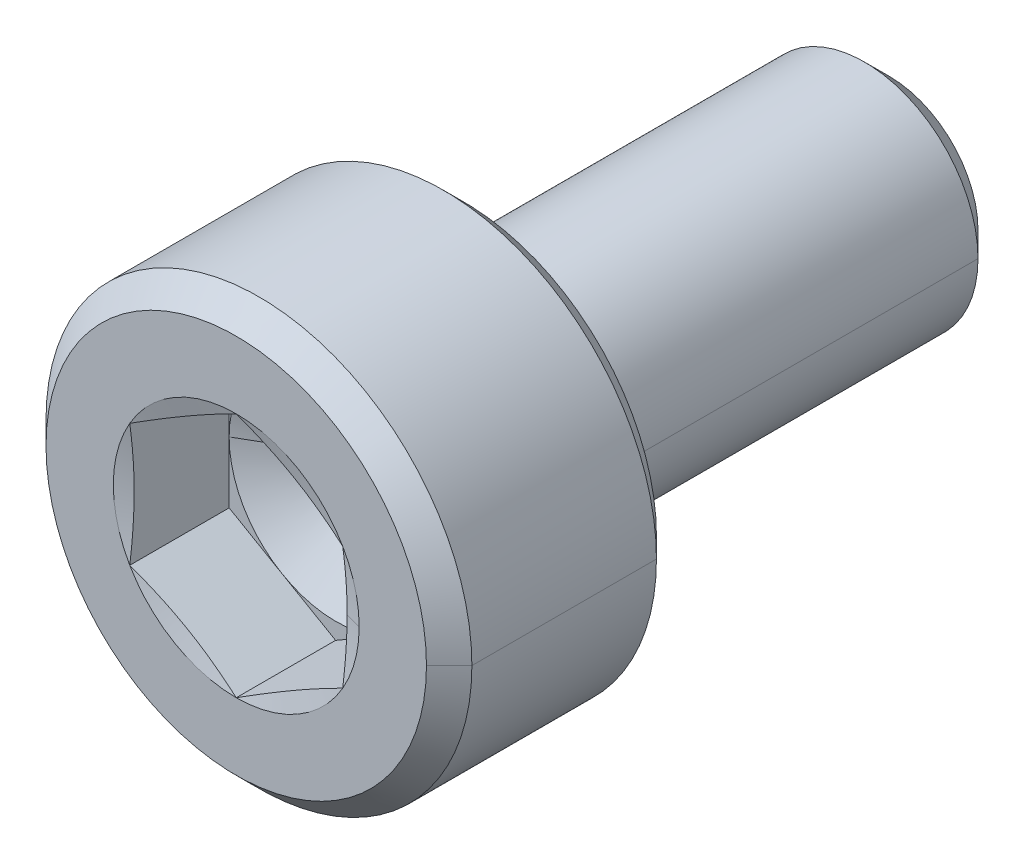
ISO-10303-21;
HEADER;
FILE_DESCRIPTION(('STEP AP214'),'2;1');
FILE_NAME('part.step','',(''),(''),'','','');
FILE_SCHEMA(('AUTOMOTIVE_DESIGN { 1 0 10303 214 1 1 1 1 }'));
ENDSEC;
DATA;
#1=APPLICATION_CONTEXT('core data for automotive mechanical design processes');
#2=APPLICATION_PROTOCOL_DEFINITION('international standard','automotive_design',2000,#1);
#3=PRODUCT_CONTEXT('',#1,'mechanical');
#4=PRODUCT('Part','Part','',(#3));
#5=PRODUCT_RELATED_PRODUCT_CATEGORY('part','',(#4));
#6=PRODUCT_DEFINITION_FORMATION('','',#4);
#7=PRODUCT_DEFINITION_CONTEXT('part definition',#1,'design');
#8=PRODUCT_DEFINITION('design','',#6,#7);
#9=PRODUCT_DEFINITION_SHAPE('','',#8);
#10=(LENGTH_UNIT() NAMED_UNIT(*) SI_UNIT(.MILLI.,.METRE.));
#11=(NAMED_UNIT(*) PLANE_ANGLE_UNIT() SI_UNIT($,.RADIAN.));
#12=(NAMED_UNIT(*) SI_UNIT($,.STERADIAN.) SOLID_ANGLE_UNIT());
#13=UNCERTAINTY_MEASURE_WITH_UNIT(LENGTH_MEASURE(1.E-05),#10,'distance_accuracy_value','');
#14=(GEOMETRIC_REPRESENTATION_CONTEXT(3) GLOBAL_UNCERTAINTY_ASSIGNED_CONTEXT((#13)) GLOBAL_UNIT_ASSIGNED_CONTEXT((#10,
#11,#12)) REPRESENTATION_CONTEXT('',''));
#15=CARTESIAN_POINT('',(0.,0.,0.));
#16=DIRECTION('',(0.,0.,1.));
#17=DIRECTION('',(1.,0.,0.));
#18=AXIS2_PLACEMENT_3D('',#15,#16,#17);
#19=CARTESIAN_POINT('',(0.75,0.433012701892,-0.7));
#20=DIRECTION('',(0.50000000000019,0.866025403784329,0.));
#21=DIRECTION('',(0.,0.,-1.));
#22=AXIS2_PLACEMENT_3D('',#19,#20,#21);
#23=PLANE('',#22);
#24=CARTESIAN_POINT('',(0.,0.866025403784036,-1.34102256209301E-13));
#25=CARTESIAN_POINT('',(0.0159598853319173,0.856809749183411,-0.00246925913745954));
#26=CARTESIAN_POINT('',(0.0319326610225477,0.847584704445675,-0.00482297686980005));
#27=CARTESIAN_POINT('',(0.0635921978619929,0.829301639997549,-0.00922985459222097));
#28=CARTESIAN_POINT('',(0.0792784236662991,0.820243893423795,-0.0112880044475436));
#29=CARTESIAN_POINT('',(0.110446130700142,0.802253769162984,-0.0151045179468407));
#30=CARTESIAN_POINT('',(0.125927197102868,0.793321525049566,-0.0168668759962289));
#31=CARTESIAN_POINT('',(0.156773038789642,0.775529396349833,-0.0200920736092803));
#32=CARTESIAN_POINT('',(0.172137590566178,0.766669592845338,-0.0215574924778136));
#33=CARTESIAN_POINT('',(0.203286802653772,0.748677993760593,-0.0242324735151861));
#34=CARTESIAN_POINT('',(0.21907163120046,0.739545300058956,-0.0254340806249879));
#35=CARTESIAN_POINT('',(0.25043259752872,0.721403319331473,-0.0274894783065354));
#36=CARTESIAN_POINT('',(0.266008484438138,0.712394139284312,-0.0283480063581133));
#37=CARTESIAN_POINT('',(0.297108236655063,0.694432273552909,-0.0297189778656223));
#38=CARTESIAN_POINT('',(0.312631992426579,0.685479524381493,-0.0302330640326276));
#39=CARTESIAN_POINT('',(0.343773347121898,0.667529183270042,-0.0309188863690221));
#40=CARTESIAN_POINT('',(0.359390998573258,0.658531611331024,-0.0310887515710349));
#41=CARTESIAN_POINT('',(0.39059960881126,0.640511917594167,-0.0310890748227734));
#42=CARTESIAN_POINT('',(0.406190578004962,0.631489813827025,-0.0309197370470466));
#43=CARTESIAN_POINT('',(0.437294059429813,0.613503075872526,-0.0302346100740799));
#44=CARTESIAN_POINT('',(0.452806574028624,0.604538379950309,-0.0297205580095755));
#45=CARTESIAN_POINT('',(0.483912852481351,0.586588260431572,-0.0283495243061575));
#46=CARTESIAN_POINT('',(0.499506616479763,0.577602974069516,-0.0274907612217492));
#47=CARTESIAN_POINT('',(0.530911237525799,0.559507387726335,-0.0254349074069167));
#48=CARTESIAN_POINT('',(0.546721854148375,0.550397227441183,-0.0242329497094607));
#49=CARTESIAN_POINT('',(0.577881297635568,0.532411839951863,-0.0215582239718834));
#50=CARTESIAN_POINT('',(0.593231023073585,0.523536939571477,-0.0200936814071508));
#51=CARTESIAN_POINT('',(0.624055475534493,0.50572232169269,-0.016869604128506));
#52=CARTESIAN_POINT('',(0.639530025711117,0.496782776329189,-0.0151074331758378));
#53=CARTESIAN_POINT('',(0.670694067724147,0.478786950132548,-0.0112908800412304));
#54=CARTESIAN_POINT('',(0.686383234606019,0.469730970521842,-0.00923244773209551));
#55=CARTESIAN_POINT('',(0.718053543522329,0.451451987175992,-0.00482454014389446));
#56=CARTESIAN_POINT('',(0.734034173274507,0.442229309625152,-0.00247002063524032));
#57=CARTESIAN_POINT('',(0.750000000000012,0.433012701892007,0.));
#58=B_SPLINE_CURVE_WITH_KNOTS('',3,(#24,#25,#26,#27,#28,#29,#30,#31,#32,#33,#34,#35,#36,#37,#38,
#39,#40,#41,#42,#43,#44,#45,#46,#47,#48,#49,#50,#51,#52,#53,#54,#55,#56,#57),.UNSPECIFIED.,.F.,
.F.,(4,2,2,2,2,2,2,2,2,2,2,2,2,2,2,2,4),(0.,0.0557827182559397,0.110471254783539,
0.164348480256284,0.217735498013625,0.2725605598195,0.326599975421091,0.380379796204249,
0.434451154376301,0.488489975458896,0.542258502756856,0.596308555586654,0.651166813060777,
0.704537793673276,0.758409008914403,0.813102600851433,0.868902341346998),.UNSPECIFIED.);
#59=CARTESIAN_POINT('',(0.,0.866025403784,0.));
#60=VERTEX_POINT('',#59);
#61=CARTESIAN_POINT('',(0.75,0.433012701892,0.));
#62=VERTEX_POINT('',#61);
#63=EDGE_CURVE('E399',#60,#62,#58,.T.);
#64=ORIENTED_EDGE('',*,*,#63,.F.);
#65=DIRECTION('',(0.,0.,1.));
#66=VECTOR('',#65,1.);
#67=CARTESIAN_POINT('',(0.,0.866025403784,-0.7));
#68=LINE('',#67,#66);
#69=CARTESIAN_POINT('',(0.,0.866025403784,-0.7));
#70=VERTEX_POINT('',#69);
#71=EDGE_CURVE('E51',#70,#60,#68,.T.);
#72=ORIENTED_EDGE('',*,*,#71,.F.);
#73=DIRECTION('',(-0.866025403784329,0.50000000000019,0.));
#74=VECTOR('',#73,1.);
#75=CARTESIAN_POINT('',(0.75,0.433012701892,-0.7));
#76=LINE('',#75,#74);
#77=CARTESIAN_POINT('',(0.375,0.649519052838,-0.7));
#78=VERTEX_POINT('',#77);
#79=EDGE_CURVE('E379',#78,#70,#76,.T.);
#80=ORIENTED_EDGE('',*,*,#79,.F.);
#81=DIRECTION('',(-0.866025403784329,0.50000000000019,0.));
#82=VECTOR('',#81,1.);
#83=CARTESIAN_POINT('',(0.75,0.433012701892,-0.7));
#84=LINE('',#83,#82);
#85=CARTESIAN_POINT('',(0.75,0.433012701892,-0.7));
#86=VERTEX_POINT('',#85);
#87=EDGE_CURVE('E391',#86,#78,#84,.T.);
#88=ORIENTED_EDGE('',*,*,#87,.F.);
#89=DIRECTION('',(0.,0.,1.));
#90=VECTOR('',#89,1.);
#91=CARTESIAN_POINT('',(0.75,0.433012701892,-0.7));
#92=LINE('',#91,#90);
#93=EDGE_CURVE('E11',#86,#62,#92,.T.);
#94=ORIENTED_EDGE('',*,*,#93,.T.);
#95=EDGE_LOOP('',(#64,#72,#80,#88,#94));
#96=FACE_BOUND('',#95,.T.);
#97=ADVANCED_FACE('F17',(#96),#23,.F.);
#98=CARTESIAN_POINT('',(0.75,-0.433012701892,-0.7));
#99=DIRECTION('',(1.,0.,0.));
#100=DIRECTION('',(0.,-1.,0.));
#101=AXIS2_PLACEMENT_3D('',#98,#99,#100);
#102=PLANE('',#101);
#103=CARTESIAN_POINT('',(0.750000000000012,0.433012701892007,0.));
#104=CARTESIAN_POINT('',(0.749998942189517,0.414599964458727,-0.00246701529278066));
#105=CARTESIAN_POINT('',(0.749996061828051,0.396171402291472,-0.00481873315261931));
#106=CARTESIAN_POINT('',(0.749991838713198,0.359645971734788,-0.00922207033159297));
#107=CARTESIAN_POINT('',(0.749990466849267,0.34154970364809,-0.0112786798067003));
#108=CARTESIAN_POINT('',(0.749993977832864,0.305597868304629,-0.0150925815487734));
#109=CARTESIAN_POINT('',(0.749998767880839,0.287742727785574,-0.016853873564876));
#110=CARTESIAN_POINT('',(0.750013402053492,0.252170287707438,-0.0200773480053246));
#111=CARTESIAN_POINT('',(0.750023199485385,0.234453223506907,-0.021542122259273));
#112=CARTESIAN_POINT('',(0.750017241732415,0.198478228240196,-0.0242195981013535));
#113=CARTESIAN_POINT('',(0.75000072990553,0.180219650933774,-0.0254236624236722));
#114=CARTESIAN_POINT('',(0.74996926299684,0.143948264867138,-0.027483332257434));
#115=CARTESIAN_POINT('',(0.749954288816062,0.125935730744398,-0.0283437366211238));
#116=CARTESIAN_POINT('',(0.7499487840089,0.0899867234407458,-0.0297169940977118));
#117=CARTESIAN_POINT('',(0.749958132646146,0.0720503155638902,-0.0302315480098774));
#118=CARTESIAN_POINT('',(0.74998101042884,0.0360759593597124,-0.0309196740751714));
#119=CARTESIAN_POINT('',(0.749994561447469,0.0180379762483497,-0.031091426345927));
#120=CARTESIAN_POINT('',(0.75,0.,-0.03108891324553));
#121=B_SPLINE_CURVE_WITH_KNOTS('',3,(#103,#104,#105,#106,#107,#108,#109,#110,#111,#112,#113,
#114,#115,#116,#117,#118,#119,#120),.UNSPECIFIED.,.F.,.F.,(4,2,2,2,2,2,2,2,4),(0.,
0.0557320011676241,0.110368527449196,0.164191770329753,0.217522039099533,0.272413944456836,
0.326510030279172,0.380338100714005,0.434451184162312),.UNSPECIFIED.);
#122=CARTESIAN_POINT('',(0.75,0.,-0.03108891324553));
#123=VERTEX_POINT('',#122);
#124=EDGE_CURVE('E272',#62,#123,#121,.T.);
#125=ORIENTED_EDGE('',*,*,#124,.F.);
#126=ORIENTED_EDGE('',*,*,#93,.F.);
#127=DIRECTION('',(0.,1.,0.));
#128=VECTOR('',#127,1.);
#129=CARTESIAN_POINT('',(0.75,-0.433012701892,-0.7));
#130=LINE('',#129,#128);
#131=CARTESIAN_POINT('',(0.75,0.,-0.7));
#132=VERTEX_POINT('',#131);
#133=EDGE_CURVE('E349',#132,#86,#130,.T.);
#134=ORIENTED_EDGE('',*,*,#133,.F.);
#135=DIRECTION('',(0.,1.,0.));
#136=VECTOR('',#135,1.);
#137=CARTESIAN_POINT('',(0.75,-0.433012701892,-0.7));
#138=LINE('',#137,#136);
#139=CARTESIAN_POINT('',(0.75,-0.433012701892,-0.7));
#140=VERTEX_POINT('',#139);
#141=EDGE_CURVE('E410',#140,#132,#138,.T.);
#142=ORIENTED_EDGE('',*,*,#141,.F.);
#143=DIRECTION('',(0.,0.,1.));
#144=VECTOR('',#143,1.);
#145=CARTESIAN_POINT('',(0.75,-0.433012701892,-0.7));
#146=LINE('',#145,#144);
#147=CARTESIAN_POINT('',(0.75,-0.433012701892,0.));
#148=VERTEX_POINT('',#147);
#149=EDGE_CURVE('E28',#140,#148,#146,.T.);
#150=ORIENTED_EDGE('',*,*,#149,.T.);
#151=CARTESIAN_POINT('',(0.75,0.,-0.03108891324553));
#152=CARTESIAN_POINT('',(0.749994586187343,-0.0180232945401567,-0.0310914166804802));
#153=CARTESIAN_POINT('',(0.749981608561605,-0.0360465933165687,-0.030919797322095));
#154=CARTESIAN_POINT('',(0.749960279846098,-0.0719949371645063,-0.0302323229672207));
#155=CARTESIAN_POINT('',(0.749951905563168,-0.0899200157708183,-0.0297182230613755));
#156=CARTESIAN_POINT('',(0.749959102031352,-0.125849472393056,-0.0283462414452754));
#157=CARTESIAN_POINT('',(0.749974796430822,-0.143853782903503,-0.0274866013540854));
#158=CARTESIAN_POINT('',(0.750006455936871,-0.180111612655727,-0.025428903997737));
#159=CARTESIAN_POINT('',(0.750022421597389,-0.198364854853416,-0.0242260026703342));
#160=CARTESIAN_POINT('',(0.750026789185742,-0.234343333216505,-0.0215500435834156));
#161=CARTESIAN_POINT('',(0.750015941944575,-0.252069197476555,-0.0200853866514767));
#162=CARTESIAN_POINT('',(0.749999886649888,-0.287659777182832,-0.0168616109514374));
#163=CARTESIAN_POINT('',(0.749994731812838,-0.305524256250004,-0.0150998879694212));
#164=CARTESIAN_POINT('',(0.749990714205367,-0.341495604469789,-0.0112846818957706));
#165=CARTESIAN_POINT('',(0.749991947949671,-0.359602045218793,-0.00922718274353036));
#166=CARTESIAN_POINT('',(0.749996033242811,-0.396148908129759,-0.00482160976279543));
#167=CARTESIAN_POINT('',(0.749998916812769,-0.414588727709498,-0.00246852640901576));
#168=CARTESIAN_POINT('',(0.750000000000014,-0.433012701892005,0.));
#169=B_SPLINE_CURVE_WITH_KNOTS('',3,(#151,#152,#153,#154,#155,#156,#157,#158,#159,#160,#161,
#162,#163,#164,#165,#166,#167,#168),.UNSPECIFIED.,.F.,.F.,(4,2,2,2,2,2,2,2,4),(0.,
0.0540690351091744,0.107863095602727,0.161934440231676,0.216810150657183,0.270166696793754,
0.324017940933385,0.378685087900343,0.434451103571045),.UNSPECIFIED.);
#170=EDGE_CURVE('E659',#123,#148,#169,.T.);
#171=ORIENTED_EDGE('',*,*,#170,.F.);
#172=EDGE_LOOP('',(#125,#126,#134,#142,#150,#171));
#173=FACE_BOUND('',#172,.T.);
#174=ADVANCED_FACE('F592',(#173),#102,.F.);
#175=CARTESIAN_POINT('',(0.,-0.866025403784,-0.7));
#176=DIRECTION('',(0.50000000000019,-0.866025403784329,0.));
#177=DIRECTION('',(0.,0.,-1.));
#178=AXIS2_PLACEMENT_3D('',#175,#176,#177);
#179=PLANE('',#178);
#180=CARTESIAN_POINT('',(0.750000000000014,-0.433012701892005,0.));
#181=CARTESIAN_POINT('',(0.734039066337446,-0.442226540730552,-0.00246925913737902));
#182=CARTESIAN_POINT('',(0.718063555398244,-0.451446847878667,-0.00482297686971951));
#183=CARTESIAN_POINT('',(0.686400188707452,-0.469723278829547,-0.00922985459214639));
#184=CARTESIAN_POINT('',(0.670712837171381,-0.478779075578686,-0.0112880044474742));
#185=CARTESIAN_POINT('',(0.639549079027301,-0.496776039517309,-0.0151045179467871));
#186=CARTESIAN_POINT('',(0.624072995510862,-0.505716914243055,-0.016866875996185));
#187=CARTESIAN_POINT('',(0.593241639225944,-0.523534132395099,-0.0200920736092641));
#188=CARTESIAN_POINT('',(0.577886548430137,-0.532410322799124,-0.0215574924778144));
#189=CARTESIAN_POINT('',(0.546730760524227,-0.550390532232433,-0.0242324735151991));
#190=CARTESIAN_POINT('',(0.530929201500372,-0.559494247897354,-0.0254340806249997));
#191=CARTESIAN_POINT('',(0.499537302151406,-0.577582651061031,-0.0274894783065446));
#192=CARTESIAN_POINT('',(0.48394717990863,-0.586567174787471,-0.0283480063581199));
#193=CARTESIAN_POINT('',(0.452841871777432,-0.604519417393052,-0.029718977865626));
#194=CARTESIAN_POINT('',(0.4373266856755,-0.613487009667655,-0.0302330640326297));
#195=CARTESIAN_POINT('',(0.406210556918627,-0.631481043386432,-0.0309188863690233));
#196=CARTESIAN_POINT('',(0.390609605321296,-0.640507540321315,-0.0310887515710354));
#197=CARTESIAN_POINT('',(0.359399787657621,-0.658525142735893,-0.0310890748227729));
#198=CARTESIAN_POINT('',(0.343790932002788,-0.667516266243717,-0.0309197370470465));
#199=CARTESIAN_POINT('',(0.312662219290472,-0.685459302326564,-0.0302346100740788));
#200=CARTESIAN_POINT('',(0.2971423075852,-0.694411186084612,-0.0297205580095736));
#201=CARTESIAN_POINT('',(0.266043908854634,-0.712374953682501,-0.0283495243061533));
#202=CARTESIAN_POINT('',(0.250465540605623,-0.721386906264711,-0.0274907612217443));
#203=CARTESIAN_POINT('',(0.219091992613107,-0.739536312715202,-0.0254349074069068));
#204=CARTESIAN_POINT('',(0.203297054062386,-0.748673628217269,-0.0242329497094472));
#205=CARTESIAN_POINT('',(0.172141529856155,-0.76666580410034,-0.0215582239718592));
#206=CARTESIAN_POINT('',(0.15678077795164,-0.775521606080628,-0.0200936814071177));
#207=CARTESIAN_POINT('',(0.125940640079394,-0.793309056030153,-0.0168696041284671));
#208=CARTESIAN_POINT('',(0.110461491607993,-0.802240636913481,-0.0151074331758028));
#209=CARTESIAN_POINT('',(0.0792946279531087,-0.820231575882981,-0.0112908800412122));
#210=CARTESIAN_POINT('',(0.0636073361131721,-0.829290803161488,-0.00923244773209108));
#211=CARTESIAN_POINT('',(0.0319421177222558,-0.847578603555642,-0.0048245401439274));
#212=CARTESIAN_POINT('',(0.015964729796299,-0.85680689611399,-0.00247002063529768));
#213=CARTESIAN_POINT('',(0.,-0.866025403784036,-1.34102256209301E-13));
#214=B_SPLINE_CURVE_WITH_KNOTS('',3,(#180,#181,#182,#183,#184,#185,#186,#187,#188,#189,#190,
#191,#192,#193,#194,#195,#196,#197,#198,#199,#200,#201,#202,#203,#204,#205,#206,#207,#208,#209,
#210,#211,#212,#213),.UNSPECIFIED.,.F.,.F.,(4,2,2,2,2,2,2,2,2,2,2,2,2,2,2,2,4),(0.,
0.0557827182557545,0.110471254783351,0.164348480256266,0.217735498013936,0.272560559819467,
0.326599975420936,0.380379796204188,0.434451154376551,0.488489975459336,0.54225850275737,
0.596308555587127,0.651166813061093,0.704537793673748,0.758409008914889,0.813102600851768,
0.868902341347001),.UNSPECIFIED.);
#215=CARTESIAN_POINT('',(0.,-0.866025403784,0.));
#216=VERTEX_POINT('',#215);
#217=EDGE_CURVE('E632',#148,#216,#214,.T.);
#218=ORIENTED_EDGE('',*,*,#217,.F.);
#219=ORIENTED_EDGE('',*,*,#149,.F.);
#220=DIRECTION('',(0.866025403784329,0.50000000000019,0.));
#221=VECTOR('',#220,1.);
#222=CARTESIAN_POINT('',(0.,-0.866025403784,-0.7));
#223=LINE('',#222,#221);
#224=CARTESIAN_POINT('',(0.375,-0.649519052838,-0.7));
#225=VERTEX_POINT('',#224);
#226=EDGE_CURVE('E406',#225,#140,#223,.T.);
#227=ORIENTED_EDGE('',*,*,#226,.F.);
#228=DIRECTION('',(0.866025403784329,0.50000000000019,0.));
#229=VECTOR('',#228,1.);
#230=CARTESIAN_POINT('',(0.,-0.866025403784,-0.7));
#231=LINE('',#230,#229);
#232=CARTESIAN_POINT('',(0.,-0.866025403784,-0.7));
#233=VERTEX_POINT('',#232);
#234=EDGE_CURVE('E308',#233,#225,#231,.T.);
#235=ORIENTED_EDGE('',*,*,#234,.F.);
#236=DIRECTION('',(0.,0.,1.));
#237=VECTOR('',#236,1.);
#238=CARTESIAN_POINT('',(0.,-0.866025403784,-0.7));
#239=LINE('',#238,#237);
#240=EDGE_CURVE('E545',#233,#216,#239,.T.);
#241=ORIENTED_EDGE('',*,*,#240,.T.);
#242=EDGE_LOOP('',(#218,#219,#227,#235,#241));
#243=FACE_BOUND('',#242,.T.);
#244=ADVANCED_FACE('F584',(#243),#179,.F.);
#245=CARTESIAN_POINT('',(-0.75,-0.433012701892,-0.7));
#246=DIRECTION('',(-0.50000000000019,-0.866025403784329,0.));
#247=DIRECTION('',(-0.866025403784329,0.50000000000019,0.));
#248=AXIS2_PLACEMENT_3D('',#245,#246,#247);
#249=PLANE('',#248);
#250=CARTESIAN_POINT('',(0.,-0.866025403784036,-1.34102256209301E-13));
#251=CARTESIAN_POINT('',(-0.0159598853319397,-0.856809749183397,-0.0024692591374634));
#252=CARTESIAN_POINT('',(-0.0319326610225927,-0.847584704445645,-0.00482297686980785));
#253=CARTESIAN_POINT('',(-0.0635921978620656,-0.829301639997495,-0.00922985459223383));
#254=CARTESIAN_POINT('',(-0.0792784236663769,-0.820243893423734,-0.0112880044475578));
#255=CARTESIAN_POINT('',(-0.110446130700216,-0.802253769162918,-0.0151045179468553));
#256=CARTESIAN_POINT('',(-0.125927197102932,-0.793321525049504,-0.0168668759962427));
#257=CARTESIAN_POINT('',(-0.15677303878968,-0.775529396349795,-0.020092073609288));
#258=CARTESIAN_POINT('',(-0.172137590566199,-0.766669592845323,-0.0215574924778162));
#259=CARTESIAN_POINT('',(-0.203286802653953,-0.748677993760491,-0.024232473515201));
#260=CARTESIAN_POINT('',(-0.219071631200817,-0.739545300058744,-0.0254340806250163));
#261=CARTESIAN_POINT('',(-0.250432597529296,-0.721403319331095,-0.0274894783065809));
#262=CARTESIAN_POINT('',(-0.266008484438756,-0.712394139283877,-0.0283480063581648));
#263=CARTESIAN_POINT('',(-0.297108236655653,-0.694432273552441,-0.0297189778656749));
#264=CARTESIAN_POINT('',(-0.312631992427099,-0.685479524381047,-0.030233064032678));
#265=CARTESIAN_POINT('',(-0.343773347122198,-0.667529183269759,-0.0309188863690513));
#266=CARTESIAN_POINT('',(-0.359390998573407,-0.658531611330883,-0.0310887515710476));
#267=CARTESIAN_POINT('',(-0.390599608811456,-0.640511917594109,-0.0310890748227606));
#268=CARTESIAN_POINT('',(-0.406190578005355,-0.631489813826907,-0.0309197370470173));
#269=CARTESIAN_POINT('',(-0.437294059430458,-0.6135030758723,-0.0302346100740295));
#270=CARTESIAN_POINT('',(-0.452806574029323,-0.604538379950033,-0.0297205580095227));
#271=CARTESIAN_POINT('',(-0.483912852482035,-0.586588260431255,-0.0283495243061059));
#272=CARTESIAN_POINT('',(-0.499506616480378,-0.577602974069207,-0.0274907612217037));
#273=CARTESIAN_POINT('',(-0.530911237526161,-0.559507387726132,-0.0254349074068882));
#274=CARTESIAN_POINT('',(-0.546721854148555,-0.550397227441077,-0.0242329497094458));
#275=CARTESIAN_POINT('',(-0.577881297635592,-0.532411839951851,-0.0215582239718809));
#276=CARTESIAN_POINT('',(-0.593231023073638,-0.523536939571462,-0.0200936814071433));
#277=CARTESIAN_POINT('',(-0.62405547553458,-0.505722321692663,-0.0168696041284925));
#278=CARTESIAN_POINT('',(-0.63953002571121,-0.496782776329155,-0.0151074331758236));
#279=CARTESIAN_POINT('',(-0.670694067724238,-0.478786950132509,-0.0112908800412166));
#280=CARTESIAN_POINT('',(-0.686383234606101,-0.469730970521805,-0.00923244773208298));
#281=CARTESIAN_POINT('',(-0.718053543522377,-0.451451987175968,-0.00482454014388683));
#282=CARTESIAN_POINT('',(-0.73403417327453,-0.44222930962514,-0.00247002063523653));
#283=CARTESIAN_POINT('',(-0.750000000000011,-0.433012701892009,0.));
#284=B_SPLINE_CURVE_WITH_KNOTS('',3,(#250,#251,#252,#253,#254,#255,#256,#257,#258,#259,#260,
#261,#262,#263,#264,#265,#266,#267,#268,#269,#270,#271,#272,#273,#274,#275,#276,#277,#278,#279,
#280,#281,#282,#283),.UNSPECIFIED.,.F.,.F.,(4,2,2,2,2,2,2,2,2,2,2,2,2,2,2,2,4),(0.,
0.0557827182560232,0.110471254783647,0.164348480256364,0.217735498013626,0.272560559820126,
0.326599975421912,0.380379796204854,0.434451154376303,0.488489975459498,0.542258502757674,
0.59630855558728,0.651166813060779,0.704537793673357,0.758409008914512,0.813102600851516,
0.868902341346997),.UNSPECIFIED.);
#285=CARTESIAN_POINT('',(-0.75,-0.433012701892,0.));
#286=VERTEX_POINT('',#285);
#287=EDGE_CURVE('E558',#216,#286,#284,.T.);
#288=ORIENTED_EDGE('',*,*,#287,.F.);
#289=ORIENTED_EDGE('',*,*,#240,.F.);
#290=DIRECTION('',(0.866025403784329,-0.50000000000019,0.));
#291=VECTOR('',#290,1.);
#292=CARTESIAN_POINT('',(-0.75,-0.433012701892,-0.7));
#293=LINE('',#292,#291);
#294=CARTESIAN_POINT('',(-0.375,-0.649519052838,-0.7));
#295=VERTEX_POINT('',#294);
#296=EDGE_CURVE('E411',#295,#233,#293,.T.);
#297=ORIENTED_EDGE('',*,*,#296,.F.);
#298=DIRECTION('',(0.866025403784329,-0.50000000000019,0.));
#299=VECTOR('',#298,1.);
#300=CARTESIAN_POINT('',(-0.75,-0.433012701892,-0.7));
#301=LINE('',#300,#299);
#302=CARTESIAN_POINT('',(-0.75,-0.433012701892,-0.7));
#303=VERTEX_POINT('',#302);
#304=EDGE_CURVE('E307',#303,#295,#301,.T.);
#305=ORIENTED_EDGE('',*,*,#304,.F.);
#306=DIRECTION('',(0.,0.,1.));
#307=VECTOR('',#306,1.);
#308=CARTESIAN_POINT('',(-0.75,-0.433012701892,-0.7));
#309=LINE('',#308,#307);
#310=EDGE_CURVE('E542',#303,#286,#309,.T.);
#311=ORIENTED_EDGE('',*,*,#310,.T.);
#312=EDGE_LOOP('',(#288,#289,#297,#305,#311));
#313=FACE_BOUND('',#312,.T.);
#314=ADVANCED_FACE('F472',(#313),#249,.F.);
#315=CARTESIAN_POINT('',(-0.75,0.433012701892,-0.7));
#316=DIRECTION('',(-1.,0.,0.));
#317=DIRECTION('',(0.,0.,1.));
#318=AXIS2_PLACEMENT_3D('',#315,#316,#317);
#319=PLANE('',#318);
#320=CARTESIAN_POINT('',(-0.750000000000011,-0.433012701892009,0.));
#321=CARTESIAN_POINT('',(-0.74999893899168,-0.414560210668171,-0.0024723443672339));
#322=CARTESIAN_POINT('',(-0.749996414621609,-0.396091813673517,-0.00482880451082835));
#323=CARTESIAN_POINT('',(-0.749993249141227,-0.359486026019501,-0.00924045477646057));
#324=CARTESIAN_POINT('',(-0.749992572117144,-0.341349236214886,-0.0113006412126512));
#325=CARTESIAN_POINT('',(-0.749997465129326,-0.305315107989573,-0.0151205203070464));
#326=CARTESIAN_POINT('',(-0.750002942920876,-0.287418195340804,-0.0168842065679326));
#327=CARTESIAN_POINT('',(-0.75001827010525,-0.251760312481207,-0.0201113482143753));
#328=CARTESIAN_POINT('',(-0.750028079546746,-0.233999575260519,-0.0215773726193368));
#329=CARTESIAN_POINT('',(-0.750021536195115,-0.197961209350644,-0.0242540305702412));
#330=CARTESIAN_POINT('',(-0.7500044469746,-0.17968296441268,-0.0254564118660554));
#331=CARTESIAN_POINT('',(-0.749972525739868,-0.143371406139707,-0.0275116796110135));
#332=CARTESIAN_POINT('',(-0.749957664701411,-0.125338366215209,-0.0283693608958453));
#333=CARTESIAN_POINT('',(-0.749951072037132,-0.0893468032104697,-0.0297369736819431));
#334=CARTESIAN_POINT('',(-0.749959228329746,-0.0713883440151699,-0.0302485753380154));
#335=CARTESIAN_POINT('',(-0.749983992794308,-0.0353676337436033,-0.0309277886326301));
#336=CARTESIAN_POINT('',(-0.750000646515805,-0.017305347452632,-0.0310935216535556));
#337=CARTESIAN_POINT('',(-0.749999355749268,0.0187558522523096,-0.0310841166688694));
#338=CARTESIAN_POINT('',(-0.749981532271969,0.0367547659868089,-0.0309101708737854));
#339=CARTESIAN_POINT('',(-0.749956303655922,0.0726565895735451,-0.0302164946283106));
#340=CARTESIAN_POINT('',(-0.749948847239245,0.090559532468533,-0.0296984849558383));
#341=CARTESIAN_POINT('',(-0.749956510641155,0.126446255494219,-0.0283201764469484));
#342=CARTESIAN_POINT('',(-0.749971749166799,0.144429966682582,-0.0274580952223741));
#343=CARTESIAN_POINT('',(-0.750002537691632,0.180647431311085,-0.0253962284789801));
#344=CARTESIAN_POINT('',(-0.750018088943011,0.19888090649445,-0.0241915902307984));
#345=CARTESIAN_POINT('',(-0.750021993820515,0.234796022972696,-0.0215147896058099));
#346=CARTESIAN_POINT('',(-0.750011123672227,0.252478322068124,-0.0200514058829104));
#347=CARTESIAN_POINT('',(-0.749995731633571,0.287983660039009,-0.0168313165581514));
#348=CARTESIAN_POINT('',(-0.749991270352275,0.30580646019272,-0.0150719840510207));
#349=CARTESIAN_POINT('',(-0.749988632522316,0.341695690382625,-0.0112627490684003));
#350=CARTESIAN_POINT('',(-0.749990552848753,0.359761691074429,-0.00920882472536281));
#351=CARTESIAN_POINT('',(-0.749995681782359,0.396228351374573,-0.00481155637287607));
#352=CARTESIAN_POINT('',(-0.749998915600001,0.414628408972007,-0.00246320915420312));
#353=CARTESIAN_POINT('',(-0.750000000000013,0.433012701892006,0.));
#354=B_SPLINE_CURVE_WITH_KNOTS('',3,(#320,#321,#322,#323,#324,#325,#326,#327,#328,#329,#330,
#331,#332,#333,#334,#335,#336,#337,#338,#339,#340,#341,#342,#343,#344,#345,#346,#347,#348,#349,
#350,#351,#352,#353),.UNSPECIFIED.,.F.,.F.,(4,2,2,2,2,2,2,2,2,2,2,2,2,2,2,2,4),(0.,
0.0558523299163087,0.110610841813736,0.164559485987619,0.21802062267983,0.272971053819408,
0.327128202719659,0.381022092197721,0.435207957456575,0.489203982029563,0.542931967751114,
0.596941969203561,0.651758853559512,0.704984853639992,0.758710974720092,0.813256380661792,
0.868902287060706),.UNSPECIFIED.);
#355=CARTESIAN_POINT('',(-0.75,0.433012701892,0.));
#356=VERTEX_POINT('',#355);
#357=EDGE_CURVE('E533',#286,#356,#354,.T.);
#358=ORIENTED_EDGE('',*,*,#357,.F.);
#359=ORIENTED_EDGE('',*,*,#310,.F.);
#360=DIRECTION('',(0.,-1.,0.));
#361=VECTOR('',#360,1.);
#362=CARTESIAN_POINT('',(-0.75,0.433012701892,-0.7));
#363=LINE('',#362,#361);
#364=CARTESIAN_POINT('',(-0.75,0.,-0.7));
#365=VERTEX_POINT('',#364);
#366=EDGE_CURVE('E303',#365,#303,#363,.T.);
#367=ORIENTED_EDGE('',*,*,#366,.F.);
#368=DIRECTION('',(0.,-1.,0.));
#369=VECTOR('',#368,1.);
#370=CARTESIAN_POINT('',(-0.75,0.433012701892,-0.7));
#371=LINE('',#370,#369);
#372=CARTESIAN_POINT('',(-0.75,0.433012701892,-0.7));
#373=VERTEX_POINT('',#372);
#374=EDGE_CURVE('E261',#373,#365,#371,.T.);
#375=ORIENTED_EDGE('',*,*,#374,.F.);
#376=DIRECTION('',(0.,0.,1.));
#377=VECTOR('',#376,1.);
#378=CARTESIAN_POINT('',(-0.75,0.433012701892,-0.7));
#379=LINE('',#378,#377);
#380=EDGE_CURVE('E41',#373,#356,#379,.T.);
#381=ORIENTED_EDGE('',*,*,#380,.T.);
#382=EDGE_LOOP('',(#358,#359,#367,#375,#381));
#383=FACE_BOUND('',#382,.T.);
#384=ADVANCED_FACE('F468',(#383),#319,.F.);
#385=CARTESIAN_POINT('',(0.,0.866025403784,-0.7));
#386=DIRECTION('',(-0.50000000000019,0.866025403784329,0.));
#387=DIRECTION('',(0.,0.,1.));
#388=AXIS2_PLACEMENT_3D('',#385,#386,#387);
#389=PLANE('',#388);
#390=CARTESIAN_POINT('',(-0.750000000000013,0.433012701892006,0.));
#391=CARTESIAN_POINT('',(-0.734039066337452,0.442226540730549,-0.00246925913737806));
#392=CARTESIAN_POINT('',(-0.718063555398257,0.45144684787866,-0.00482297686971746));
#393=CARTESIAN_POINT('',(-0.686400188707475,0.469723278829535,-0.00922985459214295));
#394=CARTESIAN_POINT('',(-0.670712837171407,0.478779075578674,-0.0112880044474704));
#395=CARTESIAN_POINT('',(-0.639549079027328,0.496776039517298,-0.0151045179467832));
#396=CARTESIAN_POINT('',(-0.624072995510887,0.505716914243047,-0.0168668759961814));
#397=CARTESIAN_POINT('',(-0.593241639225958,0.523534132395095,-0.0200920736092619));
#398=CARTESIAN_POINT('',(-0.577886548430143,0.532410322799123,-0.0215574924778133));
#399=CARTESIAN_POINT('',(-0.546730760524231,0.550390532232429,-0.024232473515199));
#400=CARTESIAN_POINT('',(-0.530929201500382,0.559494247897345,-0.0254340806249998));
#401=CARTESIAN_POINT('',(-0.499537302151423,0.577582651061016,-0.0274894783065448));
#402=CARTESIAN_POINT('',(-0.483947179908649,0.586567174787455,-0.02834800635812));
#403=CARTESIAN_POINT('',(-0.452841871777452,0.604519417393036,-0.0297189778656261));
#404=CARTESIAN_POINT('',(-0.437326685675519,0.613487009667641,-0.0302330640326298));
#405=CARTESIAN_POINT('',(-0.406210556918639,0.631481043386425,-0.0309188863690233));
#406=CARTESIAN_POINT('',(-0.390609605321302,0.640507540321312,-0.0310887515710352));
#407=CARTESIAN_POINT('',(-0.359399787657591,0.65852514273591,-0.0310890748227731));
#408=CARTESIAN_POINT('',(-0.343790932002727,0.667516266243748,-0.0309197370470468));
#409=CARTESIAN_POINT('',(-0.312662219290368,0.685459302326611,-0.030234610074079));
#410=CARTESIAN_POINT('',(-0.297142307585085,0.69441118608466,-0.0297205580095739));
#411=CARTESIAN_POINT('',(-0.266043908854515,0.712374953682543,-0.0283495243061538));
#412=CARTESIAN_POINT('',(-0.250465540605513,0.721386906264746,-0.0274907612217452));
#413=CARTESIAN_POINT('',(-0.21909199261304,0.739536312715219,-0.0254349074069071));
#414=CARTESIAN_POINT('',(-0.203297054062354,0.748673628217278,-0.024232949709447));
#415=CARTESIAN_POINT('',(-0.172141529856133,0.766665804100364,-0.0215582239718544));
#416=CARTESIAN_POINT('',(-0.156780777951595,0.775521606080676,-0.0200936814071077));
#417=CARTESIAN_POINT('',(-0.125940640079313,0.793309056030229,-0.0168696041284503));
#418=CARTESIAN_POINT('',(-0.110461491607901,0.802240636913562,-0.0151074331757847));
#419=CARTESIAN_POINT('',(-0.0792946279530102,0.820231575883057,-0.0112908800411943));
#420=CARTESIAN_POINT('',(-0.0636073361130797,0.829290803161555,-0.00923244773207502));
#421=CARTESIAN_POINT('',(-0.0319421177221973,0.84757860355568,-0.00482454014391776));
#422=CARTESIAN_POINT('',(-0.0159647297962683,0.856806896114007,-0.00247002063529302));
#423=CARTESIAN_POINT('',(0.,0.866025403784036,-1.34102256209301E-13));
#424=B_SPLINE_CURVE_WITH_KNOTS('',3,(#390,#391,#392,#393,#394,#395,#396,#397,#398,#399,#400,
#401,#402,#403,#404,#405,#406,#407,#408,#409,#410,#411,#412,#413,#414,#415,#416,#417,#418,#419,
#420,#421,#422,#423),.UNSPECIFIED.,.F.,.F.,(4,2,2,2,2,2,2,2,2,2,2,2,2,2,2,2,4),(0.,
0.0557827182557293,0.110471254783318,0.164348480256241,0.217735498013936,0.272560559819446,
0.326599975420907,0.380379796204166,0.43445115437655,0.488489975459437,0.542258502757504,
0.596308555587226,0.651166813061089,0.704537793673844,0.758409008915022,0.813102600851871,
0.868902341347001),.UNSPECIFIED.);
#425=EDGE_CURVE('E394',#356,#60,#424,.T.);
#426=ORIENTED_EDGE('',*,*,#425,.F.);
#427=ORIENTED_EDGE('',*,*,#380,.F.);
#428=DIRECTION('',(-0.866025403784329,-0.50000000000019,0.));
#429=VECTOR('',#428,1.);
#430=CARTESIAN_POINT('',(0.,0.866025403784,-0.7));
#431=LINE('',#430,#429);
#432=CARTESIAN_POINT('',(-0.375,0.649519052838,-0.7));
#433=VERTEX_POINT('',#432);
#434=EDGE_CURVE('E257',#433,#373,#431,.T.);
#435=ORIENTED_EDGE('',*,*,#434,.F.);
#436=DIRECTION('',(-0.866025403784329,-0.50000000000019,0.));
#437=VECTOR('',#436,1.);
#438=CARTESIAN_POINT('',(0.,0.866025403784,-0.7));
#439=LINE('',#438,#437);
#440=EDGE_CURVE('E262',#70,#433,#439,.T.);
#441=ORIENTED_EDGE('',*,*,#440,.F.);
#442=ORIENTED_EDGE('',*,*,#71,.T.);
#443=EDGE_LOOP('',(#426,#427,#435,#441,#442));
#444=FACE_BOUND('',#443,.T.);
#445=ADVANCED_FACE('F466',(#444),#389,.F.);
#446=CARTESIAN_POINT('',(0.,0.,-0.7));
#447=DIRECTION('',(0.,0.,1.));
#448=DIRECTION('',(1.,0.,0.));
#449=AXIS2_PLACEMENT_3D('',#446,#447,#448);
#450=PLANE('',#449);
#451=CARTESIAN_POINT('',(0.,0.,-0.7));
#452=DIRECTION('',(0.,0.,1.));
#453=DIRECTION('',(1.,0.,0.));
#454=AXIS2_PLACEMENT_3D('',#451,#452,#453);
#455=CIRCLE('',#454,0.75);
#456=EDGE_CURVE('E345',#433,#365,#455,.T.);
#457=ORIENTED_EDGE('',*,*,#456,.F.);
#458=ORIENTED_EDGE('',*,*,#434,.T.);
#459=ORIENTED_EDGE('',*,*,#374,.T.);
#460=EDGE_LOOP('',(#457,#458,#459));
#461=FACE_BOUND('',#460,.T.);
#462=ADVANCED_FACE('F463',(#461),#450,.T.);
#463=CARTESIAN_POINT('',(0.,0.,-0.7));
#464=DIRECTION('',(0.,0.,1.));
#465=DIRECTION('',(1.,0.,0.));
#466=AXIS2_PLACEMENT_3D('',#463,#464,#465);
#467=PLANE('',#466);
#468=CARTESIAN_POINT('',(0.,0.,-0.7));
#469=DIRECTION('',(0.,0.,1.));
#470=DIRECTION('',(1.,0.,0.));
#471=AXIS2_PLACEMENT_3D('',#468,#469,#470);
#472=CIRCLE('',#471,0.75);
#473=EDGE_CURVE('E350',#78,#433,#472,.T.);
#474=ORIENTED_EDGE('',*,*,#473,.F.);
#475=ORIENTED_EDGE('',*,*,#79,.T.);
#476=ORIENTED_EDGE('',*,*,#440,.T.);
#477=EDGE_LOOP('',(#474,#475,#476));
#478=FACE_BOUND('',#477,.T.);
#479=ADVANCED_FACE('F461',(#478),#467,.T.);
#480=CARTESIAN_POINT('',(0.,0.,-0.7));
#481=DIRECTION('',(0.,0.,1.));
#482=DIRECTION('',(1.,0.,0.));
#483=AXIS2_PLACEMENT_3D('',#480,#481,#482);
#484=PLANE('',#483);
#485=CARTESIAN_POINT('',(0.,0.,-0.7));
#486=DIRECTION('',(0.,0.,1.));
#487=DIRECTION('',(1.,0.,0.));
#488=AXIS2_PLACEMENT_3D('',#485,#486,#487);
#489=CIRCLE('',#488,0.75);
#490=EDGE_CURVE('E268',#365,#295,#489,.T.);
#491=ORIENTED_EDGE('',*,*,#490,.F.);
#492=ORIENTED_EDGE('',*,*,#366,.T.);
#493=ORIENTED_EDGE('',*,*,#304,.T.);
#494=EDGE_LOOP('',(#491,#492,#493));
#495=FACE_BOUND('',#494,.T.);
#496=ADVANCED_FACE('F457',(#495),#484,.T.);
#497=CARTESIAN_POINT('',(0.,0.,-0.7));
#498=DIRECTION('',(0.,0.,1.));
#499=DIRECTION('',(1.,0.,0.));
#500=AXIS2_PLACEMENT_3D('',#497,#498,#499);
#501=PLANE('',#500);
#502=CARTESIAN_POINT('',(0.,0.,-0.7));
#503=DIRECTION('',(0.,0.,1.));
#504=DIRECTION('',(1.,0.,0.));
#505=AXIS2_PLACEMENT_3D('',#502,#503,#504);
#506=CIRCLE('',#505,0.75);
#507=EDGE_CURVE('E263',#295,#225,#506,.T.);
#508=ORIENTED_EDGE('',*,*,#507,.F.);
#509=ORIENTED_EDGE('',*,*,#296,.T.);
#510=ORIENTED_EDGE('',*,*,#234,.T.);
#511=EDGE_LOOP('',(#508,#509,#510));
#512=FACE_BOUND('',#511,.T.);
#513=ADVANCED_FACE('F454',(#512),#501,.T.);
#514=CARTESIAN_POINT('',(0.,0.,-0.7));
#515=DIRECTION('',(0.,0.,1.));
#516=DIRECTION('',(1.,0.,0.));
#517=AXIS2_PLACEMENT_3D('',#514,#515,#516);
#518=PLANE('',#517);
#519=CARTESIAN_POINT('',(0.,0.,-0.7));
#520=DIRECTION('',(0.,0.,1.));
#521=DIRECTION('',(1.,0.,0.));
#522=AXIS2_PLACEMENT_3D('',#519,#520,#521);
#523=CIRCLE('',#522,0.75);
#524=EDGE_CURVE('E267',#225,#132,#523,.T.);
#525=ORIENTED_EDGE('',*,*,#524,.F.);
#526=ORIENTED_EDGE('',*,*,#226,.T.);
#527=ORIENTED_EDGE('',*,*,#141,.T.);
#528=EDGE_LOOP('',(#525,#526,#527));
#529=FACE_BOUND('',#528,.T.);
#530=ADVANCED_FACE('F452',(#529),#518,.T.);
#531=CARTESIAN_POINT('',(0.,0.,-0.7));
#532=DIRECTION('',(0.,0.,1.));
#533=DIRECTION('',(1.,0.,0.));
#534=AXIS2_PLACEMENT_3D('',#531,#532,#533);
#535=PLANE('',#534);
#536=CARTESIAN_POINT('',(0.,0.,-0.7));
#537=DIRECTION('',(0.,0.,1.));
#538=DIRECTION('',(1.,0.,0.));
#539=AXIS2_PLACEMENT_3D('',#536,#537,#538);
#540=CIRCLE('',#539,0.75);
#541=EDGE_CURVE('E395',#132,#78,#540,.T.);
#542=ORIENTED_EDGE('',*,*,#541,.F.);
#543=ORIENTED_EDGE('',*,*,#133,.T.);
#544=ORIENTED_EDGE('',*,*,#87,.T.);
#545=EDGE_LOOP('',(#542,#543,#544));
#546=FACE_BOUND('',#545,.T.);
#547=ADVANCED_FACE('F448',(#546),#535,.T.);
#548=CARTESIAN_POINT('',(0.,0.,998.8669872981));
#549=DIRECTION('',(0.,0.,1.));
#550=DIRECTION('',(1.,0.,0.));
#551=AXIS2_PLACEMENT_3D('',#548,#549,#550);
#552=CONICAL_SURFACE('',#551,1732.050807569,1.047197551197);
#553=DIRECTION('',(-0.866025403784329,0.,0.50000000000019));
#554=VECTOR('',#553,1.);
#555=CARTESIAN_POINT('',(0.,0.,-1.133012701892));
#556=LINE('',#555,#554);
#557=CARTESIAN_POINT('',(0.,0.,-1.133012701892));
#558=VERTEX_POINT('',#557);
#559=EDGE_CURVE('E846',#558,#365,#556,.T.);
#560=ORIENTED_EDGE('',*,*,#559,.F.);
#561=DIRECTION('',(0.866025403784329,0.,0.50000000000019));
#562=VECTOR('',#561,1.);
#563=CARTESIAN_POINT('',(0.,0.,-1.133012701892));
#564=LINE('',#563,#562);
#565=EDGE_CURVE('E851',#558,#132,#564,.T.);
#566=ORIENTED_EDGE('',*,*,#565,.T.);
#567=ORIENTED_EDGE('',*,*,#541,.T.);
#568=ORIENTED_EDGE('',*,*,#473,.T.);
#569=ORIENTED_EDGE('',*,*,#456,.T.);
#570=EDGE_LOOP('',(#560,#566,#567,#568,#569));
#571=FACE_BOUND('',#570,.T.);
#572=ADVANCED_FACE('F443',(#571),#552,.F.);
#573=CARTESIAN_POINT('',(0.,0.,-0.03108891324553));
#574=DIRECTION('',(0.,0.,1.));
#575=DIRECTION('',(1.,0.,0.));
#576=AXIS2_PLACEMENT_3D('',#573,#574,#575);
#577=CONICAL_SURFACE('',#576,0.75,1.308996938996);
#578=ORIENTED_EDGE('',*,*,#63,.T.);
#579=CARTESIAN_POINT('',(0.,0.,0.));
#580=DIRECTION('',(0.,0.,1.));
#581=DIRECTION('',(1.,0.,0.));
#582=AXIS2_PLACEMENT_3D('',#579,#580,#581);
#583=CIRCLE('',#582,0.866025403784);
#584=EDGE_CURVE('E627',#62,#60,#583,.T.);
#585=ORIENTED_EDGE('',*,*,#584,.T.);
#586=EDGE_LOOP('',(#578,#585));
#587=FACE_BOUND('',#586,.T.);
#588=ADVANCED_FACE('F432',(#587),#577,.F.);
#589=CARTESIAN_POINT('',(0.,0.,-0.03108891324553));
#590=DIRECTION('',(0.,0.,1.));
#591=DIRECTION('',(1.,0.,0.));
#592=AXIS2_PLACEMENT_3D('',#589,#590,#591);
#593=CONICAL_SURFACE('',#592,0.75,1.308996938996);
#594=DIRECTION('',(0.965925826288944,0.,0.258819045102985));
#595=VECTOR('',#594,1.);
#596=CARTESIAN_POINT('',(0.75,0.,-0.03108891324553));
#597=LINE('',#596,#595);
#598=CARTESIAN_POINT('',(0.866025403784,0.,0.));
#599=VERTEX_POINT('',#598);
#600=EDGE_CURVE('E604',#123,#599,#597,.T.);
#601=ORIENTED_EDGE('',*,*,#600,.F.);
#602=ORIENTED_EDGE('',*,*,#170,.T.);
#603=CARTESIAN_POINT('',(0.,0.,0.));
#604=DIRECTION('',(0.,0.,1.));
#605=DIRECTION('',(1.,0.,0.));
#606=AXIS2_PLACEMENT_3D('',#603,#604,#605);
#607=CIRCLE('',#606,0.866025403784);
#608=EDGE_CURVE('E622',#148,#599,#607,.T.);
#609=ORIENTED_EDGE('',*,*,#608,.T.);
#610=EDGE_LOOP('',(#601,#602,#609));
#611=FACE_BOUND('',#610,.T.);
#612=ADVANCED_FACE('F442',(#611),#593,.F.);
#613=CARTESIAN_POINT('',(0.,0.,-0.03108891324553));
#614=DIRECTION('',(0.,0.,1.));
#615=DIRECTION('',(1.,0.,0.));
#616=AXIS2_PLACEMENT_3D('',#613,#614,#615);
#617=CONICAL_SURFACE('',#616,0.75,1.308996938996);
#618=ORIENTED_EDGE('',*,*,#217,.T.);
#619=CARTESIAN_POINT('',(0.,0.,0.));
#620=DIRECTION('',(0.,0.,1.));
#621=DIRECTION('',(1.,0.,0.));
#622=AXIS2_PLACEMENT_3D('',#619,#620,#621);
#623=CIRCLE('',#622,0.866025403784);
#624=EDGE_CURVE('E336',#216,#148,#623,.T.);
#625=ORIENTED_EDGE('',*,*,#624,.T.);
#626=EDGE_LOOP('',(#618,#625));
#627=FACE_BOUND('',#626,.T.);
#628=ADVANCED_FACE('F635',(#627),#617,.F.);
#629=CARTESIAN_POINT('',(0.,0.,-0.03108891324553));
#630=DIRECTION('',(0.,0.,1.));
#631=DIRECTION('',(1.,0.,0.));
#632=AXIS2_PLACEMENT_3D('',#629,#630,#631);
#633=CONICAL_SURFACE('',#632,0.75,1.308996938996);
#634=ORIENTED_EDGE('',*,*,#287,.T.);
#635=CARTESIAN_POINT('',(0.,0.,0.));
#636=DIRECTION('',(0.,0.,1.));
#637=DIRECTION('',(1.,0.,0.));
#638=AXIS2_PLACEMENT_3D('',#635,#636,#637);
#639=CIRCLE('',#638,0.866025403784);
#640=EDGE_CURVE('E369',#286,#216,#639,.T.);
#641=ORIENTED_EDGE('',*,*,#640,.T.);
#642=EDGE_LOOP('',(#634,#641));
#643=FACE_BOUND('',#642,.T.);
#644=ADVANCED_FACE('F518',(#643),#633,.F.);
#645=CARTESIAN_POINT('',(0.,0.,-0.03108891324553));
#646=DIRECTION('',(0.,0.,1.));
#647=DIRECTION('',(1.,0.,0.));
#648=AXIS2_PLACEMENT_3D('',#645,#646,#647);
#649=CONICAL_SURFACE('',#648,0.75,1.308996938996);
#650=ORIENTED_EDGE('',*,*,#357,.T.);
#651=CARTESIAN_POINT('',(0.,0.,0.));
#652=DIRECTION('',(0.,0.,1.));
#653=DIRECTION('',(1.,0.,0.));
#654=AXIS2_PLACEMENT_3D('',#651,#652,#653);
#655=CIRCLE('',#654,0.866025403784);
#656=EDGE_CURVE('E536',#356,#286,#655,.T.);
#657=ORIENTED_EDGE('',*,*,#656,.T.);
#658=EDGE_LOOP('',(#650,#657));
#659=FACE_BOUND('',#658,.T.);
#660=ADVANCED_FACE('F512',(#659),#649,.F.);
#661=CARTESIAN_POINT('',(0.,0.,-0.03108891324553));
#662=DIRECTION('',(0.,0.,1.));
#663=DIRECTION('',(1.,0.,0.));
#664=AXIS2_PLACEMENT_3D('',#661,#662,#663);
#665=CONICAL_SURFACE('',#664,0.75,1.308996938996);
#666=CARTESIAN_POINT('',(0.,0.,0.));
#667=DIRECTION('',(0.,0.,1.));
#668=DIRECTION('',(1.,0.,0.));
#669=AXIS2_PLACEMENT_3D('',#666,#667,#668);
#670=CIRCLE('',#669,0.866025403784);
#671=EDGE_CURVE('E539',#60,#356,#670,.T.);
#672=ORIENTED_EDGE('',*,*,#671,.T.);
#673=ORIENTED_EDGE('',*,*,#425,.T.);
#674=EDGE_LOOP('',(#672,#673));
#675=FACE_BOUND('',#674,.T.);
#676=ADVANCED_FACE('F501',(#675),#665,.F.);
#677=CARTESIAN_POINT('',(0.,0.625,-4.6));
#678=DIRECTION('',(0.,0.,1.));
#679=DIRECTION('',(1.,0.,0.));
#680=AXIS2_PLACEMENT_3D('',#677,#678,#679);
#681=PLANE('',#680);
#682=CARTESIAN_POINT('',(0.,0.,-4.6));
#683=DIRECTION('',(0.,0.,1.));
#684=DIRECTION('',(1.,0.,0.));
#685=AXIS2_PLACEMENT_3D('',#682,#683,#684);
#686=CIRCLE('',#685,0.625);
#687=CARTESIAN_POINT('',(0.625,0.,-4.6));
#688=VERTEX_POINT('',#687);
#689=CARTESIAN_POINT('',(-0.625,0.,-4.6));
#690=VERTEX_POINT('',#689);
#691=EDGE_CURVE('E281',#688,#690,#686,.T.);
#692=ORIENTED_EDGE('',*,*,#691,.F.);
#693=CARTESIAN_POINT('',(0.,0.,-4.6));
#694=DIRECTION('',(0.,0.,1.));
#695=DIRECTION('',(1.,0.,0.));
#696=AXIS2_PLACEMENT_3D('',#693,#694,#695);
#697=CIRCLE('',#696,0.625);
#698=EDGE_CURVE('E383',#690,#688,#697,.T.);
#699=ORIENTED_EDGE('',*,*,#698,.F.);
#700=EDGE_LOOP('',(#692,#699));
#701=FACE_BOUND('',#700,.T.);
#702=ADVANCED_FACE('F511',(#701),#681,.F.);
#703=CARTESIAN_POINT('',(0.,0.,-4.6));
#704=DIRECTION('',(0.,0.,1.));
#705=DIRECTION('',(1.,0.,0.));
#706=AXIS2_PLACEMENT_3D('',#703,#704,#705);
#707=CONICAL_SURFACE('',#706,0.625,0.785398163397);
#708=DIRECTION('',(-0.707106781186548,0.,0.707106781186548));
#709=VECTOR('',#708,1.);
#710=CARTESIAN_POINT('',(-0.625,0.,-4.6));
#711=LINE('',#710,#709);
#712=CARTESIAN_POINT('',(-0.8,0.,-4.425));
#713=VERTEX_POINT('',#712);
#714=EDGE_CURVE('E285',#690,#713,#711,.T.);
#715=ORIENTED_EDGE('',*,*,#714,.F.);
#716=ORIENTED_EDGE('',*,*,#698,.T.);
#717=DIRECTION('',(0.707106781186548,0.,0.707106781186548));
#718=VECTOR('',#717,1.);
#719=CARTESIAN_POINT('',(0.625,0.,-4.6));
#720=LINE('',#719,#718);
#721=CARTESIAN_POINT('',(0.8,0.,-4.425));
#722=VERTEX_POINT('',#721);
#723=EDGE_CURVE('E273',#688,#722,#720,.T.);
#724=ORIENTED_EDGE('',*,*,#723,.T.);
#725=CARTESIAN_POINT('',(0.,0.,-4.425));
#726=DIRECTION('',(0.,0.,1.));
#727=DIRECTION('',(1.,0.,0.));
#728=AXIS2_PLACEMENT_3D('',#725,#726,#727);
#729=CIRCLE('',#728,0.8);
#730=EDGE_CURVE('E380',#713,#722,#729,.T.);
#731=ORIENTED_EDGE('',*,*,#730,.F.);
#732=EDGE_LOOP('',(#715,#716,#724,#731));
#733=FACE_BOUND('',#732,.T.);
#734=ADVANCED_FACE('F1063',(#733),#707,.T.);
#735=CARTESIAN_POINT('',(0.,0.,0.));
#736=DIRECTION('',(0.,0.,1.));
#737=DIRECTION('',(1.,0.,0.));
#738=AXIS2_PLACEMENT_3D('',#735,#736,#737);
#739=CYLINDRICAL_SURFACE('',#738,0.8);
#740=DIRECTION('',(0.,0.,1.));
#741=VECTOR('',#740,1.);
#742=CARTESIAN_POINT('',(-0.8,0.,0.));
#743=LINE('',#742,#741);
#744=CARTESIAN_POINT('',(-0.8,0.,-1.94));
#745=VERTEX_POINT('',#744);
#746=EDGE_CURVE('E277',#713,#745,#743,.T.);
#747=ORIENTED_EDGE('',*,*,#746,.F.);
#748=ORIENTED_EDGE('',*,*,#730,.T.);
#749=DIRECTION('',(0.,0.,1.));
#750=VECTOR('',#749,1.);
#751=CARTESIAN_POINT('',(0.8,0.,0.));
#752=LINE('',#751,#750);
#753=CARTESIAN_POINT('',(0.8,0.,-1.94));
#754=VERTEX_POINT('',#753);
#755=EDGE_CURVE('E245',#722,#754,#752,.T.);
#756=ORIENTED_EDGE('',*,*,#755,.T.);
#757=CARTESIAN_POINT('',(0.,0.,-1.94));
#758=DIRECTION('',(0.,0.,1.));
#759=DIRECTION('',(1.,0.,0.));
#760=AXIS2_PLACEMENT_3D('',#757,#758,#759);
#761=CIRCLE('',#760,0.8);
#762=EDGE_CURVE('E241',#745,#754,#761,.T.);
#763=ORIENTED_EDGE('',*,*,#762,.F.);
#764=EDGE_LOOP('',(#747,#748,#756,#763));
#765=FACE_BOUND('',#764,.T.);
#766=ADVANCED_FACE('F1073',(#765),#739,.T.);
#767=CARTESIAN_POINT('',(0.,0.,-1.94));
#768=DIRECTION('',(0.,0.,1.));
#769=DIRECTION('',(1.,0.,0.));
#770=AXIS2_PLACEMENT_3D('',#767,#768,#769);
#771=TOROIDAL_SURFACE('',#770,0.9,0.1);
#772=CARTESIAN_POINT('',(-0.9,0.,-1.94));
#773=DIRECTION('',(0.,1.,0.));
#774=DIRECTION('',(-1.,0.,0.));
#775=AXIS2_PLACEMENT_3D('',#772,#773,#774);
#776=CIRCLE('',#775,0.1);
#777=CARTESIAN_POINT('',(-0.807692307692,0.,-1.901538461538));
#778=VERTEX_POINT('',#777);
#779=EDGE_CURVE('E233',#778,#745,#776,.T.);
#780=ORIENTED_EDGE('',*,*,#779,.F.);
#781=CARTESIAN_POINT('',(0.,0.,-1.901538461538));
#782=DIRECTION('',(0.,0.,1.));
#783=DIRECTION('',(1.,0.,0.));
#784=AXIS2_PLACEMENT_3D('',#781,#782,#783);
#785=CIRCLE('',#784,0.807692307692);
#786=CARTESIAN_POINT('',(0.807692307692,0.,-1.901538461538));
#787=VERTEX_POINT('',#786);
#788=EDGE_CURVE('E220',#787,#778,#785,.T.);
#789=ORIENTED_EDGE('',*,*,#788,.F.);
#790=CARTESIAN_POINT('',(0.9,0.,-1.94));
#791=DIRECTION('',(0.,-1.,0.));
#792=DIRECTION('',(0.,0.,-1.));
#793=AXIS2_PLACEMENT_3D('',#790,#791,#792);
#794=CIRCLE('',#793,0.1);
#795=EDGE_CURVE('E229',#787,#754,#794,.T.);
#796=ORIENTED_EDGE('',*,*,#795,.T.);
#797=CARTESIAN_POINT('',(0.,0.,-1.94));
#798=DIRECTION('',(0.,0.,1.));
#799=DIRECTION('',(1.,0.,0.));
#800=AXIS2_PLACEMENT_3D('',#797,#798,#799);
#801=CIRCLE('',#800,0.8);
#802=EDGE_CURVE('E236',#754,#745,#801,.T.);
#803=ORIENTED_EDGE('',*,*,#802,.T.);
#804=EDGE_LOOP('',(#780,#789,#796,#803));
#805=FACE_BOUND('',#804,.T.);
#806=ADVANCED_FACE('F234',(#805),#771,.F.);
#807=CARTESIAN_POINT('',(0.,0.,-1.901538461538));
#808=DIRECTION('',(0.,0.,1.));
#809=DIRECTION('',(1.,0.,0.));
#810=AXIS2_PLACEMENT_3D('',#807,#808,#809);
#811=CONICAL_SURFACE('',#810,0.807692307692,0.3947911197);
#812=DIRECTION('',(-0.38461538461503,0.,0.923076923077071));
#813=VECTOR('',#812,1.);
#814=CARTESIAN_POINT('',(-0.807692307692,0.,-1.901538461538));
#815=LINE('',#814,#813);
#816=CARTESIAN_POINT('',(-0.907692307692,0.,-1.661538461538));
#817=VERTEX_POINT('',#816);
#818=EDGE_CURVE('E207',#778,#817,#815,.T.);
#819=ORIENTED_EDGE('',*,*,#818,.F.);
#820=CARTESIAN_POINT('',(0.,0.,-1.901538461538));
#821=DIRECTION('',(0.,0.,1.));
#822=DIRECTION('',(1.,0.,0.));
#823=AXIS2_PLACEMENT_3D('',#820,#821,#822);
#824=CIRCLE('',#823,0.807692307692);
#825=EDGE_CURVE('E212',#778,#787,#824,.T.);
#826=ORIENTED_EDGE('',*,*,#825,.T.);
#827=DIRECTION('',(0.38461538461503,0.,0.923076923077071));
#828=VECTOR('',#827,1.);
#829=CARTESIAN_POINT('',(0.807692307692,0.,-1.901538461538));
#830=LINE('',#829,#828);
#831=CARTESIAN_POINT('',(0.907692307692,0.,-1.661538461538));
#832=VERTEX_POINT('',#831);
#833=EDGE_CURVE('E225',#787,#832,#830,.T.);
#834=ORIENTED_EDGE('',*,*,#833,.T.);
#835=CARTESIAN_POINT('',(0.,0.,-1.661538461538));
#836=DIRECTION('',(0.,0.,1.));
#837=DIRECTION('',(1.,0.,0.));
#838=AXIS2_PLACEMENT_3D('',#835,#836,#837);
#839=CIRCLE('',#838,0.907692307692);
#840=EDGE_CURVE('E214',#817,#832,#839,.T.);
#841=ORIENTED_EDGE('',*,*,#840,.F.);
#842=EDGE_LOOP('',(#819,#826,#834,#841));
#843=FACE_BOUND('',#842,.T.);
#844=ADVANCED_FACE('F209',(#843),#811,.T.);
#845=CARTESIAN_POINT('',(0.,0.,-1.7));
#846=DIRECTION('',(0.,0.,1.));
#847=DIRECTION('',(1.,0.,0.));
#848=AXIS2_PLACEMENT_3D('',#845,#846,#847);
#849=TOROIDAL_SURFACE('',#848,1.,0.1);
#850=CARTESIAN_POINT('',(-1.,0.,-1.7));
#851=DIRECTION('',(0.,1.,0.));
#852=DIRECTION('',(-1.,0.,0.));
#853=AXIS2_PLACEMENT_3D('',#850,#851,#852);
#854=CIRCLE('',#853,0.1);
#855=CARTESIAN_POINT('',(-1.,0.,-1.6));
#856=VERTEX_POINT('',#855);
#857=EDGE_CURVE('E320',#856,#817,#854,.T.);
#858=ORIENTED_EDGE('',*,*,#857,.F.);
#859=CARTESIAN_POINT('',(0.,0.,-1.6));
#860=DIRECTION('',(0.,0.,1.));
#861=DIRECTION('',(1.,0.,0.));
#862=AXIS2_PLACEMENT_3D('',#859,#860,#861);
#863=CIRCLE('',#862,1.);
#864=CARTESIAN_POINT('',(1.,0.,-1.6));
#865=VERTEX_POINT('',#864);
#866=EDGE_CURVE('E375',#865,#856,#863,.T.);
#867=ORIENTED_EDGE('',*,*,#866,.F.);
#868=CARTESIAN_POINT('',(1.,0.,-1.7));
#869=DIRECTION('',(0.,-1.,0.));
#870=DIRECTION('',(0.,0.,-1.));
#871=AXIS2_PLACEMENT_3D('',#868,#869,#870);
#872=CIRCLE('',#871,0.1);
#873=EDGE_CURVE('E325',#865,#832,#872,.T.);
#874=ORIENTED_EDGE('',*,*,#873,.T.);
#875=CARTESIAN_POINT('',(0.,0.,-1.661538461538));
#876=DIRECTION('',(0.,0.,1.));
#877=DIRECTION('',(1.,0.,0.));
#878=AXIS2_PLACEMENT_3D('',#875,#876,#877);
#879=CIRCLE('',#878,0.907692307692);
#880=EDGE_CURVE('E219',#832,#817,#879,.T.);
#881=ORIENTED_EDGE('',*,*,#880,.T.);
#882=EDGE_LOOP('',(#858,#867,#874,#881));
#883=FACE_BOUND('',#882,.T.);
#884=ADVANCED_FACE('F1007',(#883),#849,.F.);
#885=CARTESIAN_POINT('',(0.,1.36,-1.6));
#886=DIRECTION('',(0.,0.,1.));
#887=DIRECTION('',(1.,0.,0.));
#888=AXIS2_PLACEMENT_3D('',#885,#886,#887);
#889=PLANE('',#888);
#890=ORIENTED_EDGE('',*,*,#866,.T.);
#891=CARTESIAN_POINT('',(0.,0.,-1.6));
#892=DIRECTION('',(0.,0.,1.));
#893=DIRECTION('',(1.,0.,0.));
#894=AXIS2_PLACEMENT_3D('',#891,#892,#893);
#895=CIRCLE('',#894,1.);
#896=EDGE_CURVE('E316',#856,#865,#895,.T.);
#897=ORIENTED_EDGE('',*,*,#896,.T.);
#898=EDGE_LOOP('',(#890,#897));
#899=FACE_BOUND('',#898,.T.);
#900=CARTESIAN_POINT('',(0.,0.,-1.6));
#901=DIRECTION('',(0.,0.,1.));
#902=DIRECTION('',(1.,0.,0.));
#903=AXIS2_PLACEMENT_3D('',#900,#901,#902);
#904=CIRCLE('',#903,1.36);
#905=CARTESIAN_POINT('',(1.36,0.,-1.6));
#906=VERTEX_POINT('',#905);
#907=CARTESIAN_POINT('',(-1.36,0.,-1.6));
#908=VERTEX_POINT('',#907);
#909=EDGE_CURVE('E328',#906,#908,#904,.T.);
#910=ORIENTED_EDGE('',*,*,#909,.F.);
#911=CARTESIAN_POINT('',(0.,0.,-1.6));
#912=DIRECTION('',(0.,0.,1.));
#913=DIRECTION('',(1.,0.,0.));
#914=AXIS2_PLACEMENT_3D('',#911,#912,#913);
#915=CIRCLE('',#914,1.36);
#916=EDGE_CURVE('E372',#908,#906,#915,.T.);
#917=ORIENTED_EDGE('',*,*,#916,.F.);
#918=EDGE_LOOP('',(#910,#917));
#919=FACE_BOUND('',#918,.T.);
#920=ADVANCED_FACE('F961',(#899,#919),#889,.F.);
#921=CARTESIAN_POINT('',(0.,0.,-1.6));
#922=DIRECTION('',(0.,0.,1.));
#923=DIRECTION('',(1.,0.,0.));
#924=AXIS2_PLACEMENT_3D('',#921,#922,#923);
#925=CONICAL_SURFACE('',#924,1.36,0.785398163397);
#926=DIRECTION('',(-0.707106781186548,0.,0.707106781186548));
#927=VECTOR('',#926,1.);
#928=CARTESIAN_POINT('',(-1.36,0.,-1.6));
#929=LINE('',#928,#927);
#930=CARTESIAN_POINT('',(-1.5,0.,-1.46));
#931=VERTEX_POINT('',#930);
#932=EDGE_CURVE('E255',#908,#931,#929,.T.);
#933=ORIENTED_EDGE('',*,*,#932,.F.);
#934=ORIENTED_EDGE('',*,*,#916,.T.);
#935=DIRECTION('',(0.707106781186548,0.,0.707106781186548));
#936=VECTOR('',#935,1.);
#937=CARTESIAN_POINT('',(1.36,0.,-1.6));
#938=LINE('',#937,#936);
#939=CARTESIAN_POINT('',(1.5,0.,-1.46));
#940=VERTEX_POINT('',#939);
#941=EDGE_CURVE('E295',#906,#940,#938,.T.);
#942=ORIENTED_EDGE('',*,*,#941,.T.);
#943=CARTESIAN_POINT('',(0.,0.,-1.46));
#944=DIRECTION('',(0.,0.,1.));
#945=DIRECTION('',(1.,0.,0.));
#946=AXIS2_PLACEMENT_3D('',#943,#944,#945);
#947=CIRCLE('',#946,1.5);
#948=EDGE_CURVE('E335',#931,#940,#947,.T.);
#949=ORIENTED_EDGE('',*,*,#948,.F.);
#950=EDGE_LOOP('',(#933,#934,#942,#949));
#951=FACE_BOUND('',#950,.T.);
#952=ADVANCED_FACE('F955',(#951),#925,.T.);
#953=CARTESIAN_POINT('',(0.,0.,0.));
#954=DIRECTION('',(0.,0.,1.));
#955=DIRECTION('',(1.,0.,0.));
#956=AXIS2_PLACEMENT_3D('',#953,#954,#955);
#957=CYLINDRICAL_SURFACE('',#956,1.5);
#958=DIRECTION('',(0.,0.,1.));
#959=VECTOR('',#958,1.);
#960=CARTESIAN_POINT('',(-1.5,0.,0.));
#961=LINE('',#960,#959);
#962=CARTESIAN_POINT('',(-1.5,0.,-0.16));
#963=VERTEX_POINT('',#962);
#964=EDGE_CURVE('E290',#931,#963,#961,.T.);
#965=ORIENTED_EDGE('',*,*,#964,.F.);
#966=ORIENTED_EDGE('',*,*,#948,.T.);
#967=DIRECTION('',(0.,0.,1.));
#968=VECTOR('',#967,1.);
#969=CARTESIAN_POINT('',(1.5,0.,0.));
#970=LINE('',#969,#968);
#971=CARTESIAN_POINT('',(1.5,0.,-0.16));
#972=VERTEX_POINT('',#971);
#973=EDGE_CURVE('E344',#940,#972,#970,.T.);
#974=ORIENTED_EDGE('',*,*,#973,.T.);
#975=CARTESIAN_POINT('',(0.,0.,-0.16));
#976=DIRECTION('',(0.,0.,1.));
#977=DIRECTION('',(1.,0.,0.));
#978=AXIS2_PLACEMENT_3D('',#975,#976,#977);
#979=CIRCLE('',#978,1.5);
#980=EDGE_CURVE('E332',#963,#972,#979,.T.);
#981=ORIENTED_EDGE('',*,*,#980,.F.);
#982=EDGE_LOOP('',(#965,#966,#974,#981));
#983=FACE_BOUND('',#982,.T.);
#984=ADVANCED_FACE('F960',(#983),#957,.T.);
#985=CARTESIAN_POINT('',(0.,0.,-0.16));
#986=DIRECTION('',(0.,0.,-1.));
#987=DIRECTION('',(-1.,0.,0.));
#988=AXIS2_PLACEMENT_3D('',#985,#986,#987);
#989=CONICAL_SURFACE('',#988,1.5,0.785398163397);
#990=DIRECTION('',(0.707106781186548,0.,-0.707106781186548));
#991=VECTOR('',#990,1.);
#992=CARTESIAN_POINT('',(1.5,0.,-0.16));
#993=LINE('',#992,#991);
#994=CARTESIAN_POINT('',(1.34,0.,0.));
#995=VERTEX_POINT('',#994);
#996=EDGE_CURVE('E358',#995,#972,#993,.T.);
#997=ORIENTED_EDGE('',*,*,#996,.F.);
#998=CARTESIAN_POINT('',(0.,0.,0.));
#999=DIRECTION('',(0.,0.,1.));
#1000=DIRECTION('',(1.,0.,0.));
#1001=AXIS2_PLACEMENT_3D('',#998,#999,#1000);
#1002=CIRCLE('',#1001,1.34);
#1003=CARTESIAN_POINT('',(-1.34,0.,0.));
#1004=VERTEX_POINT('',#1003);
#1005=EDGE_CURVE('E366',#1004,#995,#1002,.T.);
#1006=ORIENTED_EDGE('',*,*,#1005,.F.);
#1007=DIRECTION('',(-0.707106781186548,0.,-0.707106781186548));
#1008=VECTOR('',#1007,1.);
#1009=CARTESIAN_POINT('',(-1.5,0.,-0.16));
#1010=LINE('',#1009,#1008);
#1011=EDGE_CURVE('E362',#1004,#963,#1010,.T.);
#1012=ORIENTED_EDGE('',*,*,#1011,.T.);
#1013=ORIENTED_EDGE('',*,*,#980,.T.);
#1014=EDGE_LOOP('',(#997,#1006,#1012,#1013));
#1015=FACE_BOUND('',#1014,.T.);
#1016=ADVANCED_FACE('F982',(#1015),#989,.T.);
#1017=CARTESIAN_POINT('',(0.,0.,0.));
#1018=DIRECTION('',(0.,0.,-1.));
#1019=DIRECTION('',(0.,-1.,0.));
#1020=AXIS2_PLACEMENT_3D('',#1017,#1018,#1019);
#1021=PLANE('',#1020);
#1022=ORIENTED_EDGE('',*,*,#640,.F.);
#1023=ORIENTED_EDGE('',*,*,#656,.F.);
#1024=ORIENTED_EDGE('',*,*,#671,.F.);
#1025=ORIENTED_EDGE('',*,*,#584,.F.);
#1026=CARTESIAN_POINT('',(0.,0.,0.));
#1027=DIRECTION('',(0.,0.,1.));
#1028=DIRECTION('',(1.,0.,0.));
#1029=AXIS2_PLACEMENT_3D('',#1026,#1027,#1028);
#1030=CIRCLE('',#1029,0.866025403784);
#1031=EDGE_CURVE('E286',#599,#62,#1030,.T.);
#1032=ORIENTED_EDGE('',*,*,#1031,.F.);
#1033=ORIENTED_EDGE('',*,*,#608,.F.);
#1034=ORIENTED_EDGE('',*,*,#624,.F.);
#1035=EDGE_LOOP('',(#1022,#1023,#1024,#1025,#1032,#1033,#1034));
#1036=FACE_BOUND('',#1035,.T.);
#1037=ORIENTED_EDGE('',*,*,#1005,.T.);
#1038=CARTESIAN_POINT('',(0.,0.,0.));
#1039=DIRECTION('',(0.,0.,1.));
#1040=DIRECTION('',(1.,0.,0.));
#1041=AXIS2_PLACEMENT_3D('',#1038,#1039,#1040);
#1042=CIRCLE('',#1041,1.34);
#1043=EDGE_CURVE('E354',#995,#1004,#1042,.T.);
#1044=ORIENTED_EDGE('',*,*,#1043,.T.);
#1045=EDGE_LOOP('',(#1037,#1044));
#1046=FACE_BOUND('',#1045,.T.);
#1047=ADVANCED_FACE('F976',(#1036,#1046),#1021,.F.);
#1048=CARTESIAN_POINT('',(0.,0.,-0.16));
#1049=DIRECTION('',(0.,0.,-1.));
#1050=DIRECTION('',(-1.,0.,0.));
#1051=AXIS2_PLACEMENT_3D('',#1048,#1049,#1050);
#1052=CONICAL_SURFACE('',#1051,1.5,0.785398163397);
#1053=ORIENTED_EDGE('',*,*,#1043,.F.);
#1054=ORIENTED_EDGE('',*,*,#996,.T.);
#1055=CARTESIAN_POINT('',(0.,0.,-0.16));
#1056=DIRECTION('',(0.,0.,1.));
#1057=DIRECTION('',(1.,0.,0.));
#1058=AXIS2_PLACEMENT_3D('',#1055,#1056,#1057);
#1059=CIRCLE('',#1058,1.5);
#1060=EDGE_CURVE('E294',#972,#963,#1059,.T.);
#1061=ORIENTED_EDGE('',*,*,#1060,.T.);
#1062=ORIENTED_EDGE('',*,*,#1011,.F.);
#1063=EDGE_LOOP('',(#1053,#1054,#1061,#1062));
#1064=FACE_BOUND('',#1063,.T.);
#1065=ADVANCED_FACE('F981',(#1064),#1052,.T.);
#1066=CARTESIAN_POINT('',(0.,0.,0.));
#1067=DIRECTION('',(0.,0.,1.));
#1068=DIRECTION('',(1.,0.,0.));
#1069=AXIS2_PLACEMENT_3D('',#1066,#1067,#1068);
#1070=CYLINDRICAL_SURFACE('',#1069,1.5);
#1071=CARTESIAN_POINT('',(0.,0.,-1.46));
#1072=DIRECTION('',(0.,0.,1.));
#1073=DIRECTION('',(1.,0.,0.));
#1074=AXIS2_PLACEMENT_3D('',#1071,#1072,#1073);
#1075=CIRCLE('',#1074,1.5);
#1076=EDGE_CURVE('E340',#940,#931,#1075,.T.);
#1077=ORIENTED_EDGE('',*,*,#1076,.T.);
#1078=ORIENTED_EDGE('',*,*,#964,.T.);
#1079=ORIENTED_EDGE('',*,*,#1060,.F.);
#1080=ORIENTED_EDGE('',*,*,#973,.F.);
#1081=EDGE_LOOP('',(#1077,#1078,#1079,#1080));
#1082=FACE_BOUND('',#1081,.T.);
#1083=ADVANCED_FACE('F1001',(#1082),#1070,.T.);
#1084=CARTESIAN_POINT('',(0.,0.,-1.6));
#1085=DIRECTION('',(0.,0.,1.));
#1086=DIRECTION('',(1.,0.,0.));
#1087=AXIS2_PLACEMENT_3D('',#1084,#1085,#1086);
#1088=CONICAL_SURFACE('',#1087,1.36,0.785398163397);
#1089=ORIENTED_EDGE('',*,*,#909,.T.);
#1090=ORIENTED_EDGE('',*,*,#932,.T.);
#1091=ORIENTED_EDGE('',*,*,#1076,.F.);
#1092=ORIENTED_EDGE('',*,*,#941,.F.);
#1093=EDGE_LOOP('',(#1089,#1090,#1091,#1092));
#1094=FACE_BOUND('',#1093,.T.);
#1095=ADVANCED_FACE('F992',(#1094),#1088,.T.);
#1096=CARTESIAN_POINT('',(0.,0.,-1.7));
#1097=DIRECTION('',(0.,0.,1.));
#1098=DIRECTION('',(1.,0.,0.));
#1099=AXIS2_PLACEMENT_3D('',#1096,#1097,#1098);
#1100=TOROIDAL_SURFACE('',#1099,1.,0.1);
#1101=ORIENTED_EDGE('',*,*,#896,.F.);
#1102=ORIENTED_EDGE('',*,*,#857,.T.);
#1103=ORIENTED_EDGE('',*,*,#840,.T.);
#1104=ORIENTED_EDGE('',*,*,#873,.F.);
#1105=EDGE_LOOP('',(#1101,#1102,#1103,#1104));
#1106=FACE_BOUND('',#1105,.T.);
#1107=ADVANCED_FACE('F971',(#1106),#1100,.F.);
#1108=CARTESIAN_POINT('',(0.,0.,-1.901538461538));
#1109=DIRECTION('',(0.,0.,1.));
#1110=DIRECTION('',(1.,0.,0.));
#1111=AXIS2_PLACEMENT_3D('',#1108,#1109,#1110);
#1112=CONICAL_SURFACE('',#1111,0.807692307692,0.3947911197);
#1113=ORIENTED_EDGE('',*,*,#788,.T.);
#1114=ORIENTED_EDGE('',*,*,#818,.T.);
#1115=ORIENTED_EDGE('',*,*,#880,.F.);
#1116=ORIENTED_EDGE('',*,*,#833,.F.);
#1117=EDGE_LOOP('',(#1113,#1114,#1115,#1116));
#1118=FACE_BOUND('',#1117,.T.);
#1119=ADVANCED_FACE('F224',(#1118),#1112,.T.);
#1120=CARTESIAN_POINT('',(0.,0.,-1.94));
#1121=DIRECTION('',(0.,0.,1.));
#1122=DIRECTION('',(1.,0.,0.));
#1123=AXIS2_PLACEMENT_3D('',#1120,#1121,#1122);
#1124=TOROIDAL_SURFACE('',#1123,0.9,0.1);
#1125=ORIENTED_EDGE('',*,*,#825,.F.);
#1126=ORIENTED_EDGE('',*,*,#779,.T.);
#1127=ORIENTED_EDGE('',*,*,#762,.T.);
#1128=ORIENTED_EDGE('',*,*,#795,.F.);
#1129=EDGE_LOOP('',(#1125,#1126,#1127,#1128));
#1130=FACE_BOUND('',#1129,.T.);
#1131=ADVANCED_FACE('F243',(#1130),#1124,.F.);
#1132=CARTESIAN_POINT('',(0.,0.,0.));
#1133=DIRECTION('',(0.,0.,1.));
#1134=DIRECTION('',(1.,0.,0.));
#1135=AXIS2_PLACEMENT_3D('',#1132,#1133,#1134);
#1136=CYLINDRICAL_SURFACE('',#1135,0.8);
#1137=CARTESIAN_POINT('',(0.,0.,-4.425));
#1138=DIRECTION('',(0.,0.,1.));
#1139=DIRECTION('',(1.,0.,0.));
#1140=AXIS2_PLACEMENT_3D('',#1137,#1138,#1139);
#1141=CIRCLE('',#1140,0.8);
#1142=EDGE_CURVE('E278',#722,#713,#1141,.T.);
#1143=ORIENTED_EDGE('',*,*,#1142,.T.);
#1144=ORIENTED_EDGE('',*,*,#746,.T.);
#1145=ORIENTED_EDGE('',*,*,#802,.F.);
#1146=ORIENTED_EDGE('',*,*,#755,.F.);
#1147=EDGE_LOOP('',(#1143,#1144,#1145,#1146));
#1148=FACE_BOUND('',#1147,.T.);
#1149=ADVANCED_FACE('F926',(#1148),#1136,.T.);
#1150=CARTESIAN_POINT('',(0.,0.,-4.6));
#1151=DIRECTION('',(0.,0.,1.));
#1152=DIRECTION('',(1.,0.,0.));
#1153=AXIS2_PLACEMENT_3D('',#1150,#1151,#1152);
#1154=CONICAL_SURFACE('',#1153,0.625,0.785398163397);
#1155=ORIENTED_EDGE('',*,*,#691,.T.);
#1156=ORIENTED_EDGE('',*,*,#714,.T.);
#1157=ORIENTED_EDGE('',*,*,#1142,.F.);
#1158=ORIENTED_EDGE('',*,*,#723,.F.);
#1159=EDGE_LOOP('',(#1155,#1156,#1157,#1158));
#1160=FACE_BOUND('',#1159,.T.);
#1161=ADVANCED_FACE('F935',(#1160),#1154,.T.);
#1162=CARTESIAN_POINT('',(0.,0.,-0.03108891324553));
#1163=DIRECTION('',(0.,0.,1.));
#1164=DIRECTION('',(1.,0.,0.));
#1165=AXIS2_PLACEMENT_3D('',#1162,#1163,#1164);
#1166=CONICAL_SURFACE('',#1165,0.75,1.308996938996);
#1167=ORIENTED_EDGE('',*,*,#124,.T.);
#1168=ORIENTED_EDGE('',*,*,#600,.T.);
#1169=ORIENTED_EDGE('',*,*,#1031,.T.);
#1170=EDGE_LOOP('',(#1167,#1168,#1169));
#1171=FACE_BOUND('',#1170,.T.);
#1172=ADVANCED_FACE('F916',(#1171),#1166,.F.);
#1173=CARTESIAN_POINT('',(0.,0.,998.8669872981));
#1174=DIRECTION('',(0.,0.,1.));
#1175=DIRECTION('',(1.,0.,0.));
#1176=AXIS2_PLACEMENT_3D('',#1173,#1174,#1175);
#1177=CONICAL_SURFACE('',#1176,1732.050807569,1.047197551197);
#1178=ORIENTED_EDGE('',*,*,#565,.F.);
#1179=ORIENTED_EDGE('',*,*,#559,.T.);
#1180=ORIENTED_EDGE('',*,*,#490,.T.);
#1181=ORIENTED_EDGE('',*,*,#507,.T.);
#1182=ORIENTED_EDGE('',*,*,#524,.T.);
#1183=EDGE_LOOP('',(#1178,#1179,#1180,#1181,#1182));
#1184=FACE_BOUND('',#1183,.T.);
#1185=ADVANCED_FACE('F912',(#1184),#1177,.F.);
#1186=CLOSED_SHELL('',(#97,#174,#244,#314,#384,#445,#462,#479,#496,#513,#530,#547,#572,#588,
#612,#628,#644,#660,#676,#702,#734,#766,#806,#844,#884,#920,#952,#984,#1016,#1047,#1065,#1083,
#1095,#1107,#1119,#1131,#1149,#1161,#1172,#1185));
#1187=MANIFOLD_SOLID_BREP('B1',#1186);
#1188=ADVANCED_BREP_SHAPE_REPRESENTATION('',(#18,#1187),#14);
#1189=SHAPE_DEFINITION_REPRESENTATION(#9,#1188);
ENDSEC;
END-ISO-10303-21;
